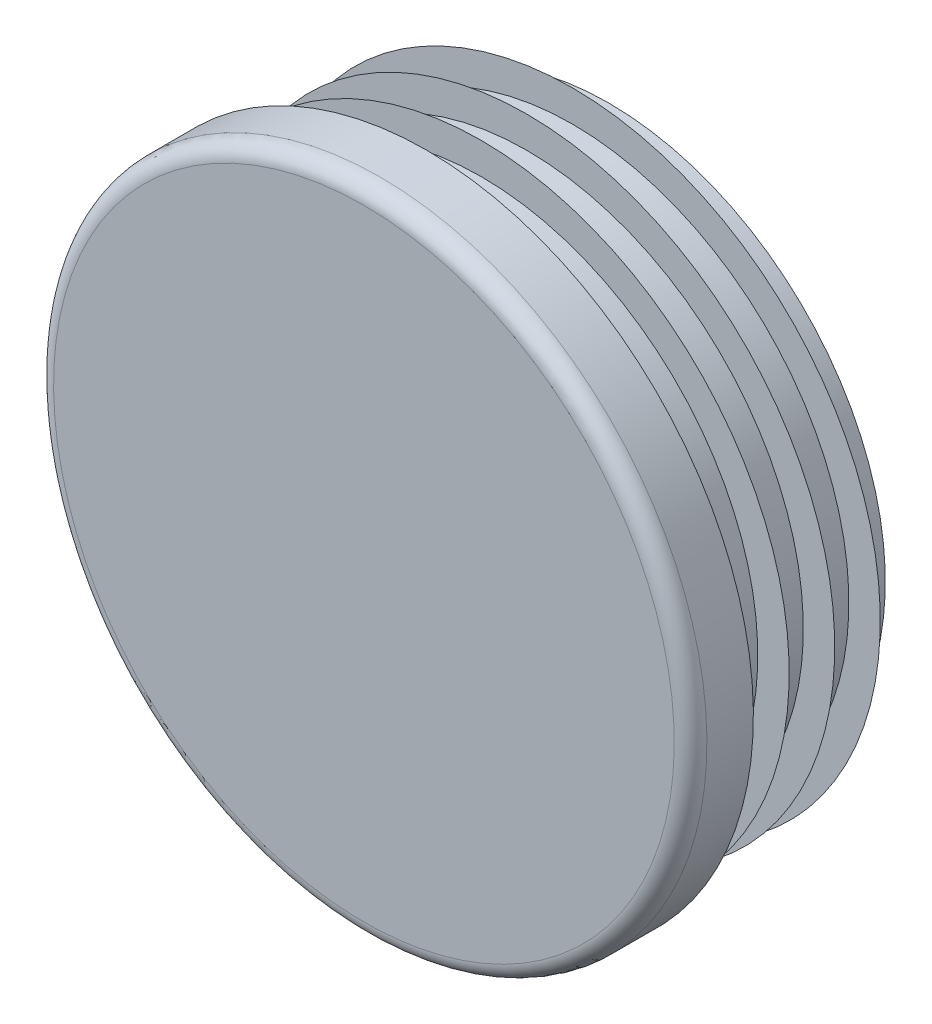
ISO-10303-21;
HEADER;
FILE_DESCRIPTION(('STEP AP214'),'2;1');
FILE_NAME('part.step','',(''),(''),'','','');
FILE_SCHEMA(('AUTOMOTIVE_DESIGN { 1 0 10303 214 1 1 1 1 }'));
ENDSEC;
DATA;
#1=APPLICATION_CONTEXT('core data for automotive mechanical design processes');
#2=APPLICATION_PROTOCOL_DEFINITION('international standard','automotive_design',2000,#1);
#3=PRODUCT_CONTEXT('',#1,'mechanical');
#4=PRODUCT('Part','Part','',(#3));
#5=PRODUCT_RELATED_PRODUCT_CATEGORY('part','',(#4));
#6=PRODUCT_DEFINITION_FORMATION('','',#4);
#7=PRODUCT_DEFINITION_CONTEXT('part definition',#1,'design');
#8=PRODUCT_DEFINITION('design','',#6,#7);
#9=PRODUCT_DEFINITION_SHAPE('','',#8);
#10=(LENGTH_UNIT() NAMED_UNIT(*) SI_UNIT(.MILLI.,.METRE.));
#11=(NAMED_UNIT(*) PLANE_ANGLE_UNIT() SI_UNIT($,.RADIAN.));
#12=(NAMED_UNIT(*) SI_UNIT($,.STERADIAN.) SOLID_ANGLE_UNIT());
#13=UNCERTAINTY_MEASURE_WITH_UNIT(LENGTH_MEASURE(1.E-05),#10,'distance_accuracy_value','');
#14=(GEOMETRIC_REPRESENTATION_CONTEXT(3) GLOBAL_UNCERTAINTY_ASSIGNED_CONTEXT((#13)) GLOBAL_UNIT_ASSIGNED_CONTEXT((#10,
#11,#12)) REPRESENTATION_CONTEXT('',''));
#15=CARTESIAN_POINT('',(0.,0.,0.));
#16=DIRECTION('',(0.,0.,1.));
#17=DIRECTION('',(1.,0.,0.));
#18=AXIS2_PLACEMENT_3D('',#15,#16,#17);
#19=CARTESIAN_POINT('',(0.,0.,5.));
#20=DIRECTION('',(0.,0.,-1.));
#21=DIRECTION('',(0.,1.,0.));
#22=AXIS2_PLACEMENT_3D('',#19,#20,#21);
#23=PLANE('',#22);
#24=CARTESIAN_POINT('',(0.,0.,5.));
#25=DIRECTION('',(0.,0.,-1.));
#26=DIRECTION('',(0.,1.,0.));
#27=AXIS2_PLACEMENT_3D('',#24,#25,#26);
#28=CIRCLE('',#27,24.7);
#29=CARTESIAN_POINT('',(0.,24.7,5.));
#30=VERTEX_POINT('',#29);
#31=EDGE_CURVE('E8',#30,#30,#28,.T.);
#32=ORIENTED_EDGE('',*,*,#31,.F.);
#33=EDGE_LOOP('',(#32));
#34=FACE_BOUND('',#33,.T.);
#35=ADVANCED_FACE('F12',(#34),#23,.F.);
#36=CARTESIAN_POINT('',(0.,0.,3.7));
#37=DIRECTION('',(0.,0.,-1.));
#38=DIRECTION('',(0.,1.,0.));
#39=AXIS2_PLACEMENT_3D('',#36,#37,#38);
#40=TOROIDAL_SURFACE('',#39,24.7,1.3);
#41=ORIENTED_EDGE('',*,*,#31,.T.);
#42=EDGE_LOOP('',(#41));
#43=FACE_BOUND('',#42,.T.);
#44=CARTESIAN_POINT('',(0.,0.,3.70000001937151));
#45=DIRECTION('',(0.,0.,-1.));
#46=DIRECTION('',(0.,1.,0.));
#47=AXIS2_PLACEMENT_3D('',#44,#45,#46);
#48=CIRCLE('',#47,26.);
#49=CARTESIAN_POINT('',(0.,26.,3.70000001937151));
#50=VERTEX_POINT('',#49);
#51=EDGE_CURVE('E18',#50,#50,#48,.T.);
#52=ORIENTED_EDGE('',*,*,#51,.F.);
#53=EDGE_LOOP('',(#52));
#54=FACE_BOUND('',#53,.T.);
#55=ADVANCED_FACE('F159',(#43,#54),#40,.T.);
#56=CARTESIAN_POINT('',(0.,0.,-14.5));
#57=DIRECTION('',(0.,0.,-1.));
#58=DIRECTION('',(0.,1.,0.));
#59=AXIS2_PLACEMENT_3D('',#56,#57,#58);
#60=CYLINDRICAL_SURFACE('',#59,26.);
#61=CARTESIAN_POINT('',(0.,0.,0.));
#62=DIRECTION('',(0.,0.,-1.));
#63=DIRECTION('',(0.,1.,0.));
#64=AXIS2_PLACEMENT_3D('',#61,#62,#63);
#65=CIRCLE('',#64,26.);
#66=CARTESIAN_POINT('',(0.,26.,0.));
#67=VERTEX_POINT('',#66);
#68=EDGE_CURVE('E22',#67,#67,#65,.T.);
#69=ORIENTED_EDGE('',*,*,#68,.F.);
#70=EDGE_LOOP('',(#69));
#71=FACE_BOUND('',#70,.T.);
#72=ORIENTED_EDGE('',*,*,#51,.T.);
#73=EDGE_LOOP('',(#72));
#74=FACE_BOUND('',#73,.T.);
#75=ADVANCED_FACE('F154',(#71,#74),#60,.T.);
#76=CARTESIAN_POINT('',(26.,0.,0.));
#77=DIRECTION('',(0.,0.,1.));
#78=DIRECTION('',(0.,-1.,0.));
#79=AXIS2_PLACEMENT_3D('',#76,#77,#78);
#80=PLANE('',#79);
#81=CARTESIAN_POINT('',(0.,0.,0.));
#82=DIRECTION('',(0.,0.,-1.));
#83=DIRECTION('',(0.,1.,0.));
#84=AXIS2_PLACEMENT_3D('',#81,#82,#83);
#85=CIRCLE('',#84,22.);
#86=CARTESIAN_POINT('',(0.,22.,0.));
#87=VERTEX_POINT('',#86);
#88=EDGE_CURVE('E26',#87,#87,#85,.T.);
#89=ORIENTED_EDGE('',*,*,#88,.F.);
#90=EDGE_LOOP('',(#89));
#91=FACE_BOUND('',#90,.T.);
#92=ORIENTED_EDGE('',*,*,#68,.T.);
#93=EDGE_LOOP('',(#92));
#94=FACE_BOUND('',#93,.T.);
#95=ADVANCED_FACE('F148',(#91,#94),#80,.F.);
#96=CARTESIAN_POINT('',(0.,0.,-14.5));
#97=DIRECTION('',(0.,0.,-1.));
#98=DIRECTION('',(0.,1.,0.));
#99=AXIS2_PLACEMENT_3D('',#96,#97,#98);
#100=CYLINDRICAL_SURFACE('',#99,22.);
#101=CARTESIAN_POINT('',(0.,0.,-0.725));
#102=DIRECTION('',(0.,0.,-1.));
#103=DIRECTION('',(0.,1.,0.));
#104=AXIS2_PLACEMENT_3D('',#101,#102,#103);
#105=CIRCLE('',#104,22.);
#106=CARTESIAN_POINT('',(0.,22.,-0.725));
#107=VERTEX_POINT('',#106);
#108=EDGE_CURVE('E31',#107,#107,#105,.T.);
#109=ORIENTED_EDGE('',*,*,#108,.F.);
#110=EDGE_LOOP('',(#109));
#111=FACE_BOUND('',#110,.T.);
#112=ORIENTED_EDGE('',*,*,#88,.T.);
#113=EDGE_LOOP('',(#112));
#114=FACE_BOUND('',#113,.T.);
#115=ADVANCED_FACE('F142',(#111,#114),#100,.T.);
#116=CARTESIAN_POINT('',(22.,0.,-0.725));
#117=DIRECTION('',(0.,0.,-1.));
#118=DIRECTION('',(0.,1.,0.));
#119=AXIS2_PLACEMENT_3D('',#116,#117,#118);
#120=PLANE('',#119);
#121=CARTESIAN_POINT('',(0.,0.,-0.725));
#122=DIRECTION('',(0.,0.,-1.));
#123=DIRECTION('',(0.,1.,0.));
#124=AXIS2_PLACEMENT_3D('',#121,#122,#123);
#125=CIRCLE('',#124,24.5);
#126=CARTESIAN_POINT('',(0.,24.5,-0.725));
#127=VERTEX_POINT('',#126);
#128=EDGE_CURVE('E34',#127,#127,#125,.T.);
#129=ORIENTED_EDGE('',*,*,#128,.F.);
#130=EDGE_LOOP('',(#129));
#131=FACE_BOUND('',#130,.T.);
#132=ORIENTED_EDGE('',*,*,#108,.T.);
#133=EDGE_LOOP('',(#132));
#134=FACE_BOUND('',#133,.T.);
#135=ADVANCED_FACE('F136',(#131,#134),#120,.F.);
#136=CARTESIAN_POINT('',(0.,0.,-0.725));
#137=DIRECTION('',(0.,0.,1.));
#138=DIRECTION('',(0.,-1.,0.));
#139=AXIS2_PLACEMENT_3D('',#136,#137,#138);
#140=CONICAL_SURFACE('',#139,24.5,0.959931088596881);
#141=CARTESIAN_POINT('',(0.,0.,-2.47551884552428));
#142=DIRECTION('',(0.,0.,-1.));
#143=DIRECTION('',(0.,1.,0.));
#144=AXIS2_PLACEMENT_3D('',#141,#142,#143);
#145=CIRCLE('',#144,22.);
#146=CARTESIAN_POINT('',(0.,22.,-2.47551884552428));
#147=VERTEX_POINT('',#146);
#148=EDGE_CURVE('E37',#147,#147,#145,.T.);
#149=ORIENTED_EDGE('',*,*,#148,.F.);
#150=EDGE_LOOP('',(#149));
#151=FACE_BOUND('',#150,.T.);
#152=ORIENTED_EDGE('',*,*,#128,.T.);
#153=EDGE_LOOP('',(#152));
#154=FACE_BOUND('',#153,.T.);
#155=ADVANCED_FACE('F130',(#151,#154),#140,.T.);
#156=CARTESIAN_POINT('',(0.,0.,-14.5));
#157=DIRECTION('',(0.,0.,-1.));
#158=DIRECTION('',(0.,1.,0.));
#159=AXIS2_PLACEMENT_3D('',#156,#157,#158);
#160=CYLINDRICAL_SURFACE('',#159,22.);
#161=CARTESIAN_POINT('',(0.,0.,-4.35));
#162=DIRECTION('',(0.,0.,-1.));
#163=DIRECTION('',(0.,1.,0.));
#164=AXIS2_PLACEMENT_3D('',#161,#162,#163);
#165=CIRCLE('',#164,22.);
#166=CARTESIAN_POINT('',(0.,22.,-4.35));
#167=VERTEX_POINT('',#166);
#168=EDGE_CURVE('E40',#167,#167,#165,.T.);
#169=ORIENTED_EDGE('',*,*,#168,.F.);
#170=EDGE_LOOP('',(#169));
#171=FACE_BOUND('',#170,.T.);
#172=ORIENTED_EDGE('',*,*,#148,.T.);
#173=EDGE_LOOP('',(#172));
#174=FACE_BOUND('',#173,.T.);
#175=ADVANCED_FACE('F124',(#171,#174),#160,.T.);
#176=CARTESIAN_POINT('',(22.,0.,-4.35));
#177=DIRECTION('',(0.,0.,-1.));
#178=DIRECTION('',(0.,1.,0.));
#179=AXIS2_PLACEMENT_3D('',#176,#177,#178);
#180=PLANE('',#179);
#181=CARTESIAN_POINT('',(0.,0.,-4.35));
#182=DIRECTION('',(0.,0.,-1.));
#183=DIRECTION('',(0.,1.,0.));
#184=AXIS2_PLACEMENT_3D('',#181,#182,#183);
#185=CIRCLE('',#184,24.5);
#186=CARTESIAN_POINT('',(0.,24.5,-4.35));
#187=VERTEX_POINT('',#186);
#188=EDGE_CURVE('E43',#187,#187,#185,.T.);
#189=ORIENTED_EDGE('',*,*,#188,.F.);
#190=EDGE_LOOP('',(#189));
#191=FACE_BOUND('',#190,.T.);
#192=ORIENTED_EDGE('',*,*,#168,.T.);
#193=EDGE_LOOP('',(#192));
#194=FACE_BOUND('',#193,.T.);
#195=ADVANCED_FACE('F118',(#191,#194),#180,.F.);
#196=CARTESIAN_POINT('',(0.,0.,-4.35));
#197=DIRECTION('',(0.,0.,1.));
#198=DIRECTION('',(0.,-1.,0.));
#199=AXIS2_PLACEMENT_3D('',#196,#197,#198);
#200=CONICAL_SURFACE('',#199,24.5,0.959931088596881);
#201=CARTESIAN_POINT('',(0.,0.,-6.10051884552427));
#202=DIRECTION('',(0.,0.,-1.));
#203=DIRECTION('',(0.,1.,0.));
#204=AXIS2_PLACEMENT_3D('',#201,#202,#203);
#205=CIRCLE('',#204,22.);
#206=CARTESIAN_POINT('',(0.,22.,-6.10051884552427));
#207=VERTEX_POINT('',#206);
#208=EDGE_CURVE('E46',#207,#207,#205,.T.);
#209=ORIENTED_EDGE('',*,*,#208,.F.);
#210=EDGE_LOOP('',(#209));
#211=FACE_BOUND('',#210,.T.);
#212=ORIENTED_EDGE('',*,*,#188,.T.);
#213=EDGE_LOOP('',(#212));
#214=FACE_BOUND('',#213,.T.);
#215=ADVANCED_FACE('F112',(#211,#214),#200,.T.);
#216=CARTESIAN_POINT('',(0.,0.,-14.5));
#217=DIRECTION('',(0.,0.,-1.));
#218=DIRECTION('',(0.,1.,0.));
#219=AXIS2_PLACEMENT_3D('',#216,#217,#218);
#220=CYLINDRICAL_SURFACE('',#219,22.);
#221=CARTESIAN_POINT('',(0.,0.,-7.975));
#222=DIRECTION('',(0.,0.,-1.));
#223=DIRECTION('',(0.,1.,0.));
#224=AXIS2_PLACEMENT_3D('',#221,#222,#223);
#225=CIRCLE('',#224,22.);
#226=CARTESIAN_POINT('',(0.,22.,-7.975));
#227=VERTEX_POINT('',#226);
#228=EDGE_CURVE('E49',#227,#227,#225,.T.);
#229=ORIENTED_EDGE('',*,*,#228,.F.);
#230=EDGE_LOOP('',(#229));
#231=FACE_BOUND('',#230,.T.);
#232=ORIENTED_EDGE('',*,*,#208,.T.);
#233=EDGE_LOOP('',(#232));
#234=FACE_BOUND('',#233,.T.);
#235=ADVANCED_FACE('F106',(#231,#234),#220,.T.);
#236=CARTESIAN_POINT('',(22.,0.,-7.975));
#237=DIRECTION('',(0.,0.,-1.));
#238=DIRECTION('',(0.,1.,0.));
#239=AXIS2_PLACEMENT_3D('',#236,#237,#238);
#240=PLANE('',#239);
#241=CARTESIAN_POINT('',(0.,0.,-7.975));
#242=DIRECTION('',(0.,0.,-1.));
#243=DIRECTION('',(0.,1.,0.));
#244=AXIS2_PLACEMENT_3D('',#241,#242,#243);
#245=CIRCLE('',#244,24.5);
#246=CARTESIAN_POINT('',(0.,24.5,-7.975));
#247=VERTEX_POINT('',#246);
#248=EDGE_CURVE('E52',#247,#247,#245,.T.);
#249=ORIENTED_EDGE('',*,*,#248,.F.);
#250=EDGE_LOOP('',(#249));
#251=FACE_BOUND('',#250,.T.);
#252=ORIENTED_EDGE('',*,*,#228,.T.);
#253=EDGE_LOOP('',(#252));
#254=FACE_BOUND('',#253,.T.);
#255=ADVANCED_FACE('F100',(#251,#254),#240,.F.);
#256=CARTESIAN_POINT('',(0.,0.,-7.975));
#257=DIRECTION('',(0.,0.,1.));
#258=DIRECTION('',(0.,-1.,0.));
#259=AXIS2_PLACEMENT_3D('',#256,#257,#258);
#260=CONICAL_SURFACE('',#259,24.5,0.959931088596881);
#261=CARTESIAN_POINT('',(0.,0.,-9.72551884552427));
#262=DIRECTION('',(0.,0.,-1.));
#263=DIRECTION('',(0.,1.,0.));
#264=AXIS2_PLACEMENT_3D('',#261,#262,#263);
#265=CIRCLE('',#264,22.);
#266=CARTESIAN_POINT('',(0.,22.,-9.72551884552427));
#267=VERTEX_POINT('',#266);
#268=EDGE_CURVE('E55',#267,#267,#265,.T.);
#269=ORIENTED_EDGE('',*,*,#268,.F.);
#270=EDGE_LOOP('',(#269));
#271=FACE_BOUND('',#270,.T.);
#272=ORIENTED_EDGE('',*,*,#248,.T.);
#273=EDGE_LOOP('',(#272));
#274=FACE_BOUND('',#273,.T.);
#275=ADVANCED_FACE('F94',(#271,#274),#260,.T.);
#276=CARTESIAN_POINT('',(0.,0.,-14.5));
#277=DIRECTION('',(0.,0.,-1.));
#278=DIRECTION('',(0.,1.,0.));
#279=AXIS2_PLACEMENT_3D('',#276,#277,#278);
#280=CYLINDRICAL_SURFACE('',#279,22.);
#281=CARTESIAN_POINT('',(0.,0.,-11.6));
#282=DIRECTION('',(0.,0.,-1.));
#283=DIRECTION('',(0.,1.,0.));
#284=AXIS2_PLACEMENT_3D('',#281,#282,#283);
#285=CIRCLE('',#284,22.);
#286=CARTESIAN_POINT('',(0.,22.,-11.6));
#287=VERTEX_POINT('',#286);
#288=EDGE_CURVE('E58',#287,#287,#285,.T.);
#289=ORIENTED_EDGE('',*,*,#288,.F.);
#290=EDGE_LOOP('',(#289));
#291=FACE_BOUND('',#290,.T.);
#292=ORIENTED_EDGE('',*,*,#268,.T.);
#293=EDGE_LOOP('',(#292));
#294=FACE_BOUND('',#293,.T.);
#295=ADVANCED_FACE('F88',(#291,#294),#280,.T.);
#296=CARTESIAN_POINT('',(22.,0.,-11.6));
#297=DIRECTION('',(0.,0.,-1.));
#298=DIRECTION('',(0.,1.,0.));
#299=AXIS2_PLACEMENT_3D('',#296,#297,#298);
#300=PLANE('',#299);
#301=CARTESIAN_POINT('',(0.,0.,-11.6));
#302=DIRECTION('',(0.,0.,-1.));
#303=DIRECTION('',(0.,1.,0.));
#304=AXIS2_PLACEMENT_3D('',#301,#302,#303);
#305=CIRCLE('',#304,24.5);
#306=CARTESIAN_POINT('',(0.,24.5,-11.6));
#307=VERTEX_POINT('',#306);
#308=EDGE_CURVE('E61',#307,#307,#305,.T.);
#309=ORIENTED_EDGE('',*,*,#308,.F.);
#310=EDGE_LOOP('',(#309));
#311=FACE_BOUND('',#310,.T.);
#312=ORIENTED_EDGE('',*,*,#288,.T.);
#313=EDGE_LOOP('',(#312));
#314=FACE_BOUND('',#313,.T.);
#315=ADVANCED_FACE('F82',(#311,#314),#300,.F.);
#316=CARTESIAN_POINT('',(0.,0.,-11.6));
#317=DIRECTION('',(0.,0.,1.));
#318=DIRECTION('',(0.,-1.,0.));
#319=AXIS2_PLACEMENT_3D('',#316,#317,#318);
#320=CONICAL_SURFACE('',#319,24.5,0.959931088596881);
#321=CARTESIAN_POINT('',(0.,0.,-13.3505188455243));
#322=DIRECTION('',(0.,0.,-1.));
#323=DIRECTION('',(0.,1.,0.));
#324=AXIS2_PLACEMENT_3D('',#321,#322,#323);
#325=CIRCLE('',#324,22.);
#326=CARTESIAN_POINT('',(0.,22.,-13.3505188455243));
#327=VERTEX_POINT('',#326);
#328=EDGE_CURVE('E64',#327,#327,#325,.T.);
#329=ORIENTED_EDGE('',*,*,#328,.F.);
#330=EDGE_LOOP('',(#329));
#331=FACE_BOUND('',#330,.T.);
#332=ORIENTED_EDGE('',*,*,#308,.T.);
#333=EDGE_LOOP('',(#332));
#334=FACE_BOUND('',#333,.T.);
#335=ADVANCED_FACE('F76',(#331,#334),#320,.T.);
#336=CARTESIAN_POINT('',(0.,0.,-14.5));
#337=DIRECTION('',(0.,0.,-1.));
#338=DIRECTION('',(0.,1.,0.));
#339=AXIS2_PLACEMENT_3D('',#336,#337,#338);
#340=CYLINDRICAL_SURFACE('',#339,22.);
#341=CARTESIAN_POINT('',(0.,0.,-14.5));
#342=DIRECTION('',(0.,0.,-1.));
#343=DIRECTION('',(0.,1.,0.));
#344=AXIS2_PLACEMENT_3D('',#341,#342,#343);
#345=CIRCLE('',#344,22.);
#346=CARTESIAN_POINT('',(0.,22.,-14.5));
#347=VERTEX_POINT('',#346);
#348=EDGE_CURVE('E67',#347,#347,#345,.T.);
#349=ORIENTED_EDGE('',*,*,#348,.F.);
#350=EDGE_LOOP('',(#349));
#351=FACE_BOUND('',#350,.T.);
#352=ORIENTED_EDGE('',*,*,#328,.T.);
#353=EDGE_LOOP('',(#352));
#354=FACE_BOUND('',#353,.T.);
#355=ADVANCED_FACE('F73',(#351,#354),#340,.T.);
#356=CARTESIAN_POINT('',(22.,0.,-14.5));
#357=DIRECTION('',(0.,0.,1.));
#358=DIRECTION('',(0.,-1.,0.));
#359=AXIS2_PLACEMENT_3D('',#356,#357,#358);
#360=PLANE('',#359);
#361=ORIENTED_EDGE('',*,*,#348,.T.);
#362=EDGE_LOOP('',(#361));
#363=FACE_BOUND('',#362,.T.);
#364=ADVANCED_FACE('F71',(#363),#360,.F.);
#365=CLOSED_SHELL('',(#35,#55,#75,#95,#115,#135,#155,#175,#195,#215,#235,#255,#275,#295,#315,
#335,#355,#364));
#366=MANIFOLD_SOLID_BREP('B1',#365);
#367=ADVANCED_BREP_SHAPE_REPRESENTATION('',(#18,#366),#14);
#368=SHAPE_DEFINITION_REPRESENTATION(#9,#367);
ENDSEC;
END-ISO-10303-21;
